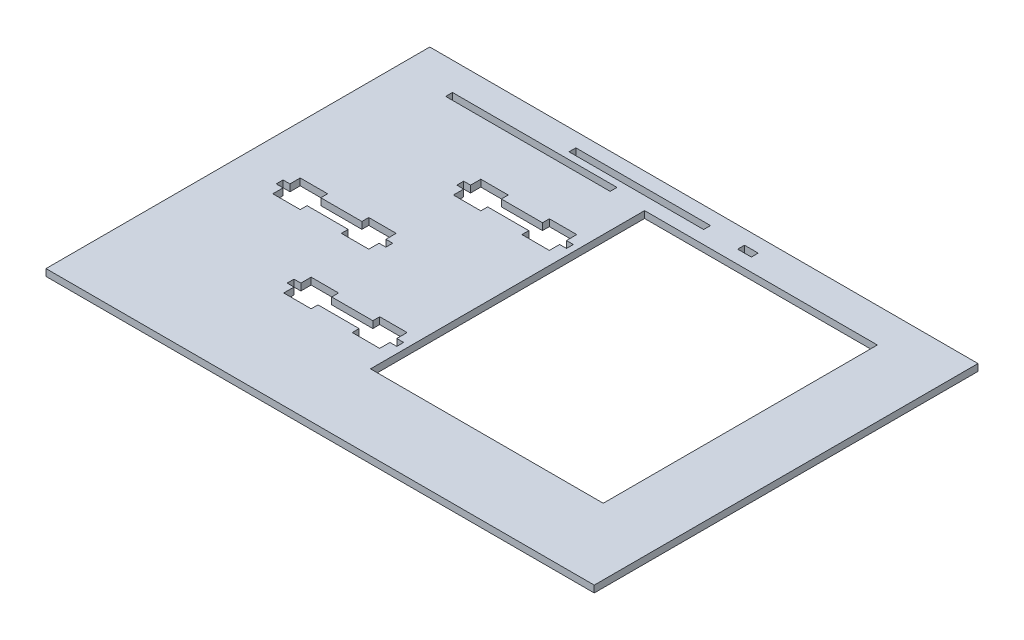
from build123d import *

# Parameters (mm, degrees)
SKETCH1_W           = 254
SKETCH1_H           = 177.8
SKETCH1_R           = 3.175
BOSS_EXTRUDE1_DEPTH = 3.175
SKETCH2_W           = 76.2
SKETCH2_H           = 3.175
SKETCH2_W_2         = 6.35
SKETCH2_W_3         = 62.369236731
SKETCH2_W_4         = 107.837917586
SKETCH2_H_2         = 127
CUT_EXTRUDE1_DEPTH  = 156.055766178


with BuildPart() as part:
    # Sketch1 → Boss-Extrude1 (new body)
    with BuildSketch(Plane(origin=(0, 0, 0), x_dir=(1, 0, 0), z_dir=(0, 1, 0))):
        Rectangle(SKETCH1_W, SKETCH1_H)
        with Locations(Location((42.3291, 0, 0), (0, 0, 270))):
            Circle(SKETCH1_R, mode=Mode.SUBTRACT)
    extrude(amount=BOSS_EXTRUDE1_DEPTH)

    # Sketch2 → Cut-Extrude1 (cut, through all)
    with BuildSketch(Plane(origin=(0, 3.175, 0), x_dir=(1, 0, 0), z_dir=(0, 1, 0))):
        with Locations((-65.399011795, 74.347806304)):
            Rectangle(SKETCH2_W, SKETCH2_H)
        with Locations((28.609350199, 80.697806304)):
            Rectangle(SKETCH2_W_2, SKETCH2_H)
        Polygon((-60.01655841, 6.35), (-72.71655841, 6.35), (-72.71655841, 3.175), (-91.76655841, 3.175), (-91.76655841, 6.35), (-104.46655841, 6.35), (-104.46655841, 3.175), (-104.46655841, 1.5875), (-107.64155841, 1.5875), (-107.64155841, -1.5875), (-104.46655841, -1.5875), (-104.46655841, -3.175), (-104.46655841, -6.35), (-91.76655841, -6.35), (-91.76655841, -3.175), (-72.71655841, -3.175), (-72.71655841, -6.35), (-60.01655841, -6.35), (-60.01655841, -3.175), (-60.01655841, -1.5875), (-56.84155841, -1.5875), (-56.84155841, 1.5875), (-60.01655841, 1.5875), (-60.01655841, 3.175), align=None)
        with Locations((-21.51439343, 80.697806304)):
            Rectangle(SKETCH2_W_3, SKETCH2_H)
        Polygon((-62.133225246, 39.749208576), (-62.133225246, 38.161708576), (-62.133225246, 34.986708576), (-49.433225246, 34.986708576), (-49.433225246, 38.161708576), (-30.383225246, 38.161708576), (-30.383225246, 34.986708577), (-17.683225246, 34.986708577), (-17.683225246, 38.161708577), (-17.683225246, 39.749208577), (-14.508225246, 39.749208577), (-14.508225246, 42.924208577), (-17.683225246, 42.924208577), (-17.683225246, 44.511708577), (-17.683225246, 47.686708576), (-30.383225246, 47.686708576), (-30.383225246, 44.511708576), (-49.433225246, 44.511708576), (-49.433225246, 47.686708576), (-62.133225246, 47.686708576), (-62.133225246, 44.511708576), (-62.133225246, 42.924208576), (-65.308225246, 42.924208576), (-65.308225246, 39.749208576), align=None)
        with Locations((42.3291, 9.525)):
            Rectangle(SKETCH2_W_4, SKETCH2_H_2)
        Polygon((-65.308225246, -35.684538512), (-65.308225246, -38.859538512), (-62.133225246, -38.859538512), (-62.133225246, -40.447038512), (-62.133225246, -43.622038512), (-49.433225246, -43.622038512), (-49.433225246, -40.447038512), (-30.383225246, -40.447038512), (-30.383225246, -43.622038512), (-17.683225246, -43.622038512), (-17.683225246, -40.447038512), (-17.683225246, -38.859538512), (-14.508225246, -38.859538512), (-14.508225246, -35.684538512), (-17.683225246, -35.684538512), (-17.683225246, -34.097038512), (-17.683225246, -30.922038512), (-30.383225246, -30.922038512), (-30.383225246, -34.097038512), (-49.433225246, -34.097038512), (-49.433225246, -30.922038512), (-62.133225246, -30.922038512), (-62.133225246, -34.097038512), (-62.133225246, -35.684538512), align=None)
    extrude(amount=-CUT_EXTRUDE1_DEPTH, mode=Mode.SUBTRACT)


solid = part.part
